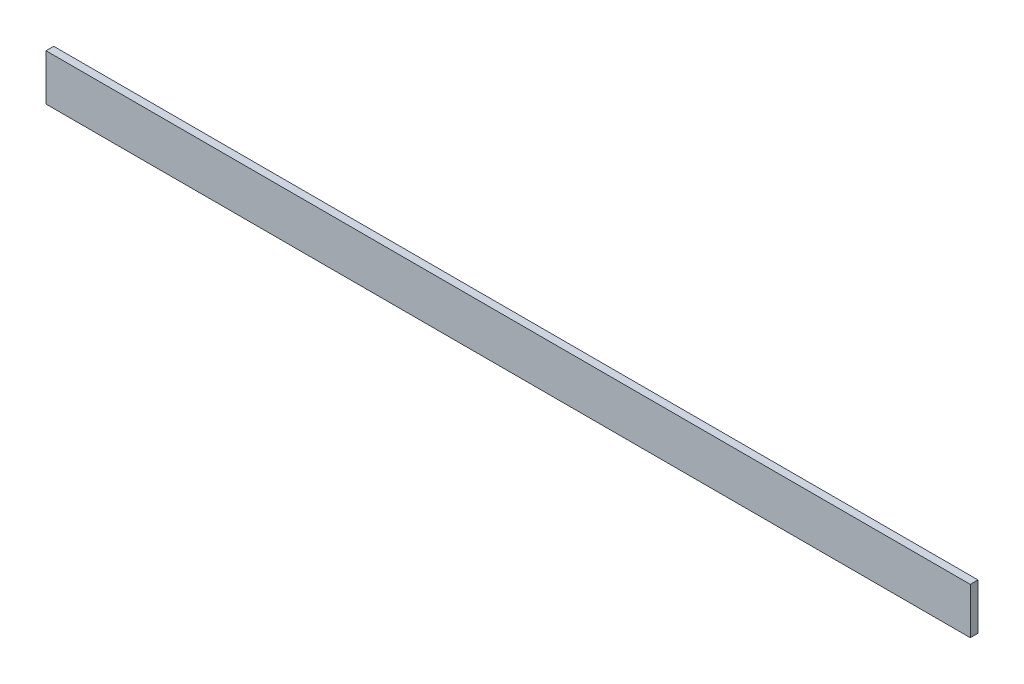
ISO-10303-21;
HEADER;
FILE_DESCRIPTION(('STEP AP214'),'2;1');
FILE_NAME('part.step','',(''),(''),'','','');
FILE_SCHEMA(('AUTOMOTIVE_DESIGN { 1 0 10303 214 1 1 1 1 }'));
ENDSEC;
DATA;
#1=APPLICATION_CONTEXT('core data for automotive mechanical design processes');
#2=APPLICATION_PROTOCOL_DEFINITION('international standard','automotive_design',2000,#1);
#3=PRODUCT_CONTEXT('',#1,'mechanical');
#4=PRODUCT('Part','Part','',(#3));
#5=PRODUCT_RELATED_PRODUCT_CATEGORY('part','',(#4));
#6=PRODUCT_DEFINITION_FORMATION('','',#4);
#7=PRODUCT_DEFINITION_CONTEXT('part definition',#1,'design');
#8=PRODUCT_DEFINITION('design','',#6,#7);
#9=PRODUCT_DEFINITION_SHAPE('','',#8);
#10=(LENGTH_UNIT() NAMED_UNIT(*) SI_UNIT(.MILLI.,.METRE.));
#11=(NAMED_UNIT(*) PLANE_ANGLE_UNIT() SI_UNIT($,.RADIAN.));
#12=(NAMED_UNIT(*) SI_UNIT($,.STERADIAN.) SOLID_ANGLE_UNIT());
#13=UNCERTAINTY_MEASURE_WITH_UNIT(LENGTH_MEASURE(1.E-05),#10,'distance_accuracy_value','');
#14=(GEOMETRIC_REPRESENTATION_CONTEXT(3) GLOBAL_UNCERTAINTY_ASSIGNED_CONTEXT((#13)) GLOBAL_UNIT_ASSIGNED_CONTEXT((#10,
#11,#12)) REPRESENTATION_CONTEXT('',''));
#15=CARTESIAN_POINT('',(0.,0.,0.));
#16=DIRECTION('',(0.,0.,1.));
#17=DIRECTION('',(1.,0.,0.));
#18=AXIS2_PLACEMENT_3D('',#15,#16,#17);
#19=CARTESIAN_POINT('',(0.,0.,10.));
#20=DIRECTION('',(1.,0.,0.));
#21=DIRECTION('',(0.,0.,-1.));
#22=AXIS2_PLACEMENT_3D('',#19,#20,#21);
#23=PLANE('',#22);
#24=DIRECTION('',(0.,-1.,0.));
#25=VECTOR('',#24,1.);
#26=CARTESIAN_POINT('',(0.,0.,0.));
#27=LINE('',#26,#25);
#28=CARTESIAN_POINT('',(0.,60.0000000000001,0.));
#29=VERTEX_POINT('',#28);
#30=CARTESIAN_POINT('',(0.,0.,0.));
#31=VERTEX_POINT('',#30);
#32=EDGE_CURVE('E80',#29,#31,#27,.T.);
#33=ORIENTED_EDGE('',*,*,#32,.T.);
#34=DIRECTION('',(0.,0.,-1.));
#35=VECTOR('',#34,1.);
#36=CARTESIAN_POINT('',(0.,0.,10.));
#37=LINE('',#36,#35);
#38=CARTESIAN_POINT('',(0.,0.,10.));
#39=VERTEX_POINT('',#38);
#40=EDGE_CURVE('E11',#39,#31,#37,.T.);
#41=ORIENTED_EDGE('',*,*,#40,.F.);
#42=DIRECTION('',(0.,-1.,0.));
#43=VECTOR('',#42,1.);
#44=CARTESIAN_POINT('',(0.,0.,10.));
#45=LINE('',#44,#43);
#46=CARTESIAN_POINT('',(0.,60.0000000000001,10.));
#47=VERTEX_POINT('',#46);
#48=EDGE_CURVE('E105',#47,#39,#45,.T.);
#49=ORIENTED_EDGE('',*,*,#48,.F.);
#50=DIRECTION('',(0.,0.,-1.));
#51=VECTOR('',#50,1.);
#52=CARTESIAN_POINT('',(0.,60.0000000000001,10.));
#53=LINE('',#52,#51);
#54=EDGE_CURVE('E93',#47,#29,#53,.T.);
#55=ORIENTED_EDGE('',*,*,#54,.T.);
#56=EDGE_LOOP('',(#33,#41,#49,#55));
#57=FACE_BOUND('',#56,.T.);
#58=ADVANCED_FACE('F36',(#57),#23,.F.);
#59=CARTESIAN_POINT('',(0.,0.,10.));
#60=DIRECTION('',(0.,1.,0.));
#61=DIRECTION('',(0.,0.,1.));
#62=AXIS2_PLACEMENT_3D('',#59,#60,#61);
#63=PLANE('',#62);
#64=DIRECTION('',(1.,0.,0.));
#65=VECTOR('',#64,1.);
#66=CARTESIAN_POINT('',(0.,0.,0.));
#67=LINE('',#66,#65);
#68=CARTESIAN_POINT('',(1200.,0.,0.));
#69=VERTEX_POINT('',#68);
#70=EDGE_CURVE('E76',#31,#69,#67,.T.);
#71=ORIENTED_EDGE('',*,*,#70,.T.);
#72=DIRECTION('',(0.,0.,-1.));
#73=VECTOR('',#72,1.);
#74=CARTESIAN_POINT('',(1200.,0.,10.));
#75=LINE('',#74,#73);
#76=CARTESIAN_POINT('',(1200.,0.,10.));
#77=VERTEX_POINT('',#76);
#78=EDGE_CURVE('E43',#77,#69,#75,.T.);
#79=ORIENTED_EDGE('',*,*,#78,.F.);
#80=DIRECTION('',(1.,0.,0.));
#81=VECTOR('',#80,1.);
#82=CARTESIAN_POINT('',(0.,0.,10.));
#83=LINE('',#82,#81);
#84=EDGE_CURVE('E89',#39,#77,#83,.T.);
#85=ORIENTED_EDGE('',*,*,#84,.F.);
#86=ORIENTED_EDGE('',*,*,#40,.T.);
#87=EDGE_LOOP('',(#71,#79,#85,#86));
#88=FACE_BOUND('',#87,.T.);
#89=ADVANCED_FACE('F88',(#88),#63,.F.);
#90=CARTESIAN_POINT('',(1200.,0.,10.));
#91=DIRECTION('',(-1.,0.,0.));
#92=DIRECTION('',(0.,0.,1.));
#93=AXIS2_PLACEMENT_3D('',#90,#91,#92);
#94=PLANE('',#93);
#95=DIRECTION('',(0.,1.,0.));
#96=VECTOR('',#95,1.);
#97=CARTESIAN_POINT('',(1200.,0.,0.));
#98=LINE('',#97,#96);
#99=CARTESIAN_POINT('',(1200.,60.0000000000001,0.));
#100=VERTEX_POINT('',#99);
#101=EDGE_CURVE('E81',#69,#100,#98,.T.);
#102=ORIENTED_EDGE('',*,*,#101,.T.);
#103=DIRECTION('',(0.,0.,-1.));
#104=VECTOR('',#103,1.);
#105=CARTESIAN_POINT('',(1200.,60.0000000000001,10.));
#106=LINE('',#105,#104);
#107=CARTESIAN_POINT('',(1200.,60.0000000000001,10.));
#108=VERTEX_POINT('',#107);
#109=EDGE_CURVE('E113',#108,#100,#106,.T.);
#110=ORIENTED_EDGE('',*,*,#109,.F.);
#111=DIRECTION('',(0.,1.,0.));
#112=VECTOR('',#111,1.);
#113=CARTESIAN_POINT('',(1200.,0.,10.));
#114=LINE('',#113,#112);
#115=EDGE_CURVE('E55',#77,#108,#114,.T.);
#116=ORIENTED_EDGE('',*,*,#115,.F.);
#117=ORIENTED_EDGE('',*,*,#78,.T.);
#118=EDGE_LOOP('',(#102,#110,#116,#117));
#119=FACE_BOUND('',#118,.T.);
#120=ADVANCED_FACE('F116',(#119),#94,.F.);
#121=CARTESIAN_POINT('',(0.,60.0000000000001,10.));
#122=DIRECTION('',(0.,-1.,0.));
#123=DIRECTION('',(0.,0.,-1.));
#124=AXIS2_PLACEMENT_3D('',#121,#122,#123);
#125=PLANE('',#124);
#126=DIRECTION('',(-1.,0.,0.));
#127=VECTOR('',#126,1.);
#128=CARTESIAN_POINT('',(0.,60.0000000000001,0.));
#129=LINE('',#128,#127);
#130=EDGE_CURVE('E102',#100,#29,#129,.T.);
#131=ORIENTED_EDGE('',*,*,#130,.T.);
#132=ORIENTED_EDGE('',*,*,#54,.F.);
#133=DIRECTION('',(-1.,0.,0.));
#134=VECTOR('',#133,1.);
#135=CARTESIAN_POINT('',(0.,60.0000000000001,10.));
#136=LINE('',#135,#134);
#137=EDGE_CURVE('E50',#108,#47,#136,.T.);
#138=ORIENTED_EDGE('',*,*,#137,.F.);
#139=ORIENTED_EDGE('',*,*,#109,.T.);
#140=EDGE_LOOP('',(#131,#132,#138,#139));
#141=FACE_BOUND('',#140,.T.);
#142=ADVANCED_FACE('F118',(#141),#125,.F.);
#143=CARTESIAN_POINT('',(0.,60.0000000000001,10.));
#144=DIRECTION('',(0.,0.,-1.));
#145=DIRECTION('',(-1.,0.,0.));
#146=AXIS2_PLACEMENT_3D('',#143,#144,#145);
#147=PLANE('',#146);
#148=ORIENTED_EDGE('',*,*,#48,.T.);
#149=ORIENTED_EDGE('',*,*,#84,.T.);
#150=ORIENTED_EDGE('',*,*,#115,.T.);
#151=ORIENTED_EDGE('',*,*,#137,.T.);
#152=EDGE_LOOP('',(#148,#149,#150,#151));
#153=FACE_BOUND('',#152,.T.);
#154=ADVANCED_FACE('F119',(#153),#147,.F.);
#155=CARTESIAN_POINT('',(0.,60.0000000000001,0.));
#156=DIRECTION('',(0.,0.,-1.));
#157=DIRECTION('',(-1.,0.,0.));
#158=AXIS2_PLACEMENT_3D('',#155,#156,#157);
#159=PLANE('',#158);
#160=ORIENTED_EDGE('',*,*,#32,.F.);
#161=ORIENTED_EDGE('',*,*,#130,.F.);
#162=ORIENTED_EDGE('',*,*,#101,.F.);
#163=ORIENTED_EDGE('',*,*,#70,.F.);
#164=EDGE_LOOP('',(#160,#161,#162,#163));
#165=FACE_BOUND('',#164,.T.);
#166=ADVANCED_FACE('F77',(#165),#159,.T.);
#167=CLOSED_SHELL('',(#58,#89,#120,#142,#154,#166));
#168=MANIFOLD_SOLID_BREP('B2',#167);
#169=ADVANCED_BREP_SHAPE_REPRESENTATION('',(#18,#168),#14);
#170=SHAPE_DEFINITION_REPRESENTATION(#9,#169);
ENDSEC;
END-ISO-10303-21;
